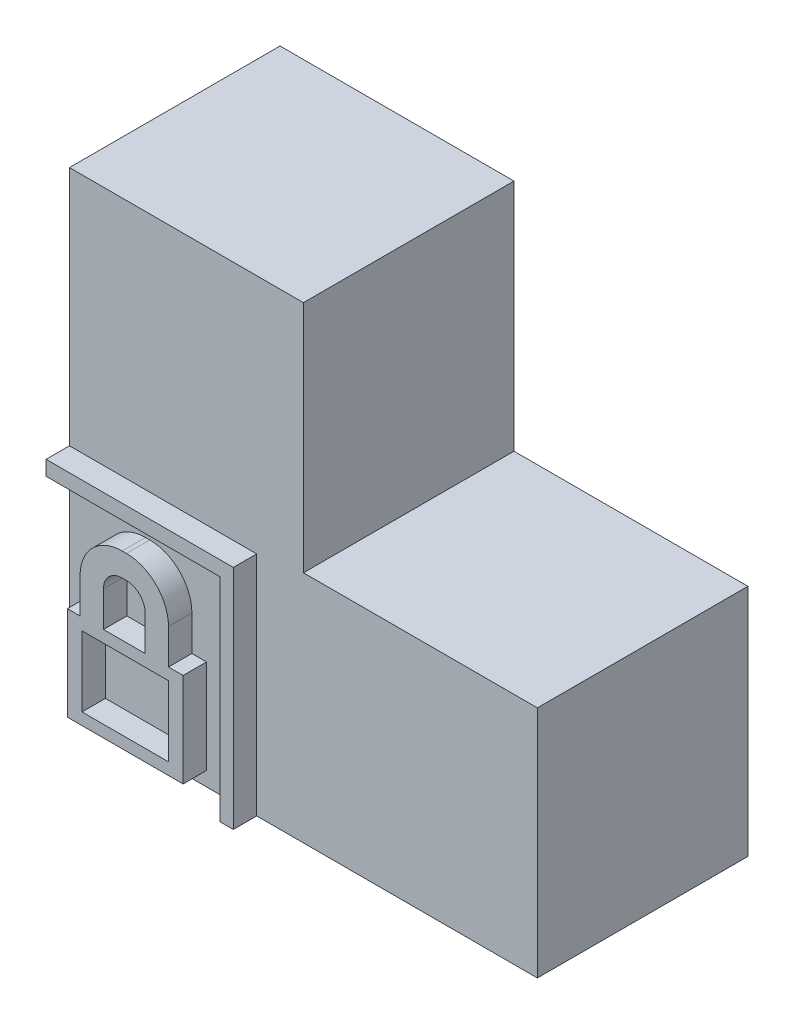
ISO-10303-21;
HEADER;
FILE_DESCRIPTION(('STEP AP214'),'2;1');
FILE_NAME('part.step','',(''),(''),'','','');
FILE_SCHEMA(('AUTOMOTIVE_DESIGN { 1 0 10303 214 1 1 1 1 }'));
ENDSEC;
DATA;
#1=APPLICATION_CONTEXT('core data for automotive mechanical design processes');
#2=APPLICATION_PROTOCOL_DEFINITION('international standard','automotive_design',2000,#1);
#3=PRODUCT_CONTEXT('',#1,'mechanical');
#4=PRODUCT('Part','Part','',(#3));
#5=PRODUCT_RELATED_PRODUCT_CATEGORY('part','',(#4));
#6=PRODUCT_DEFINITION_FORMATION('','',#4);
#7=PRODUCT_DEFINITION_CONTEXT('part definition',#1,'design');
#8=PRODUCT_DEFINITION('design','',#6,#7);
#9=PRODUCT_DEFINITION_SHAPE('','',#8);
#10=(LENGTH_UNIT() NAMED_UNIT(*) SI_UNIT(.MILLI.,.METRE.));
#11=(NAMED_UNIT(*) PLANE_ANGLE_UNIT() SI_UNIT($,.RADIAN.));
#12=(NAMED_UNIT(*) SI_UNIT($,.STERADIAN.) SOLID_ANGLE_UNIT());
#13=UNCERTAINTY_MEASURE_WITH_UNIT(LENGTH_MEASURE(1.E-05),#10,'distance_accuracy_value','');
#14=(GEOMETRIC_REPRESENTATION_CONTEXT(3) GLOBAL_UNCERTAINTY_ASSIGNED_CONTEXT((#13)) GLOBAL_UNIT_ASSIGNED_CONTEXT((#10,
#11,#12)) REPRESENTATION_CONTEXT('',''));
#15=CARTESIAN_POINT('',(0.,0.,0.));
#16=DIRECTION('',(0.,0.,1.));
#17=DIRECTION('',(1.,0.,0.));
#18=AXIS2_PLACEMENT_3D('',#15,#16,#17);
#19=CARTESIAN_POINT('',(0.,0.,-0.300000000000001));
#20=DIRECTION('',(0.,0.,1.));
#21=DIRECTION('',(1.,0.,0.));
#22=AXIS2_PLACEMENT_3D('',#19,#20,#21);
#23=PLANE('',#22);
#24=DIRECTION('',(-1.,0.,0.));
#25=VECTOR('',#24,1.);
#26=CARTESIAN_POINT('',(-0.998170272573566,20.3855136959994,-0.300000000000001));
#27=LINE('',#26,#25);
#28=CARTESIAN_POINT('',(-0.998170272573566,20.3855136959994,-0.300000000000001));
#29=VERTEX_POINT('',#28);
#30=CARTESIAN_POINT('',(-5.,20.3855136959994,-0.300000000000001));
#31=VERTEX_POINT('',#30);
#32=EDGE_CURVE('E47',#29,#31,#27,.T.);
#33=ORIENTED_EDGE('',*,*,#32,.F.);
#34=DIRECTION('',(0.,1.,0.));
#35=VECTOR('',#34,1.);
#36=CARTESIAN_POINT('',(-0.998170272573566,15.5354081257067,-0.300000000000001));
#37=LINE('',#36,#35);
#38=CARTESIAN_POINT('',(-0.998170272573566,15.5354081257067,-0.300000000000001));
#39=VERTEX_POINT('',#38);
#40=EDGE_CURVE('E479',#39,#29,#37,.T.);
#41=ORIENTED_EDGE('',*,*,#40,.F.);
#42=DIRECTION('',(1.,0.,0.));
#43=VECTOR('',#42,1.);
#44=CARTESIAN_POINT('',(-5.,15.5354081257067,-0.300000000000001));
#45=LINE('',#44,#43);
#46=CARTESIAN_POINT('',(5.,15.5354081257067,-0.300000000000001));
#47=VERTEX_POINT('',#46);
#48=EDGE_CURVE('E264',#39,#47,#45,.T.);
#49=ORIENTED_EDGE('',*,*,#48,.T.);
#50=DIRECTION('',(0.,1.,0.));
#51=VECTOR('',#50,1.);
#52=CARTESIAN_POINT('',(5.,20.5354081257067,-0.300000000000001));
#53=LINE('',#52,#51);
#54=CARTESIAN_POINT('',(5.,20.5354081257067,-0.300000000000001));
#55=VERTEX_POINT('',#54);
#56=EDGE_CURVE('E414',#47,#55,#53,.T.);
#57=ORIENTED_EDGE('',*,*,#56,.T.);
#58=DIRECTION('',(-1.,0.,0.));
#59=VECTOR('',#58,1.);
#60=CARTESIAN_POINT('',(0.,20.5354081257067,-0.300000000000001));
#61=LINE('',#60,#59);
#62=CARTESIAN_POINT('',(0.,20.5354081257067,-0.300000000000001));
#63=VERTEX_POINT('',#62);
#64=EDGE_CURVE('E417',#55,#63,#61,.T.);
#65=ORIENTED_EDGE('',*,*,#64,.T.);
#66=DIRECTION('',(0.,1.,0.));
#67=VECTOR('',#66,1.);
#68=CARTESIAN_POINT('',(0.,25.5354081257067,-0.300000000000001));
#69=LINE('',#68,#67);
#70=CARTESIAN_POINT('',(0.,25.5354081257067,-0.300000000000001));
#71=VERTEX_POINT('',#70);
#72=EDGE_CURVE('E420',#63,#71,#69,.T.);
#73=ORIENTED_EDGE('',*,*,#72,.T.);
#74=DIRECTION('',(-1.,0.,0.));
#75=VECTOR('',#74,1.);
#76=CARTESIAN_POINT('',(-5.,25.5354081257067,-0.300000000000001));
#77=LINE('',#76,#75);
#78=CARTESIAN_POINT('',(-5.,25.5354081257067,-0.300000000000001));
#79=VERTEX_POINT('',#78);
#80=EDGE_CURVE('E422',#71,#79,#77,.T.);
#81=ORIENTED_EDGE('',*,*,#80,.T.);
#82=DIRECTION('',(0.,-1.,0.));
#83=VECTOR('',#82,1.);
#84=CARTESIAN_POINT('',(-5.,25.5354081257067,-0.300000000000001));
#85=LINE('',#84,#83);
#86=EDGE_CURVE('E425',#79,#31,#85,.T.);
#87=ORIENTED_EDGE('',*,*,#86,.T.);
#88=EDGE_LOOP('',(#33,#41,#49,#57,#65,#73,#81,#87));
#89=FACE_BOUND('',#88,.T.);
#90=ADVANCED_FACE('F32',(#89),#23,.T.);
#91=DIRECTION('',(-1.,0.,0.));
#92=VECTOR('',#91,1.);
#93=CARTESIAN_POINT('',(-2.38364349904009,17.8496393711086,-0.300000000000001));
#94=LINE('',#93,#92);
#95=CARTESIAN_POINT('',(-2.07135715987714,17.8496393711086,-0.300000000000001));
#96=VERTEX_POINT('',#95);
#97=CARTESIAN_POINT('',(-2.38364349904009,17.8496393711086,-0.300000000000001));
#98=VERTEX_POINT('',#97);
#99=EDGE_CURVE('E368',#96,#98,#94,.T.);
#100=ORIENTED_EDGE('',*,*,#99,.F.);
#101=DIRECTION('',(0.,1.,0.));
#102=VECTOR('',#101,1.);
#103=CARTESIAN_POINT('',(-2.07135715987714,17.8496393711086,-0.300000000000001));
#104=LINE('',#103,#102);
#105=CARTESIAN_POINT('',(-2.07135715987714,15.8405534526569,-0.300000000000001));
#106=VERTEX_POINT('',#105);
#107=EDGE_CURVE('E342',#106,#96,#104,.T.);
#108=ORIENTED_EDGE('',*,*,#107,.F.);
#109=DIRECTION('',(1.,0.,0.));
#110=VECTOR('',#109,1.);
#111=CARTESIAN_POINT('',(-4.54407030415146,15.8405534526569,-0.300000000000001));
#112=LINE('',#111,#110);
#113=CARTESIAN_POINT('',(-4.54407030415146,15.8405534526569,-0.300000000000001));
#114=VERTEX_POINT('',#113);
#115=EDGE_CURVE('E347',#114,#106,#112,.T.);
#116=ORIENTED_EDGE('',*,*,#115,.F.);
#117=DIRECTION('',(0.,-1.,0.));
#118=VECTOR('',#117,1.);
#119=CARTESIAN_POINT('',(-4.54407030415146,17.8496393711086,-0.300000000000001));
#120=LINE('',#119,#118);
#121=CARTESIAN_POINT('',(-4.54407030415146,17.8496393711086,-0.300000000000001));
#122=VERTEX_POINT('',#121);
#123=EDGE_CURVE('E382',#122,#114,#120,.T.);
#124=ORIENTED_EDGE('',*,*,#123,.F.);
#125=DIRECTION('',(-1.,0.,0.));
#126=VECTOR('',#125,1.);
#127=CARTESIAN_POINT('',(-4.54407030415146,17.8496393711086,-0.300000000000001));
#128=LINE('',#127,#126);
#129=CARTESIAN_POINT('',(-4.27338849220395,17.8496393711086,-0.300000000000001));
#130=VERTEX_POINT('',#129);
#131=EDGE_CURVE('E380',#130,#122,#128,.T.);
#132=ORIENTED_EDGE('',*,*,#131,.F.);
#133=DIRECTION('',(0.,-1.,0.));
#134=VECTOR('',#133,1.);
#135=CARTESIAN_POINT('',(-4.27338849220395,17.8496393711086,-0.300000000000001));
#136=LINE('',#135,#134);
#137=CARTESIAN_POINT('',(-4.27338849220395,18.60203802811,-0.300000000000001));
#138=VERTEX_POINT('',#137);
#139=EDGE_CURVE('E378',#138,#130,#136,.T.);
#140=ORIENTED_EDGE('',*,*,#139,.F.);
#141=CARTESIAN_POINT('',(-3.37338849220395,18.60203802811,-0.300000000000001));
#142=DIRECTION('',(0.,0.,1.));
#143=DIRECTION('',(-1.,0.,0.));
#144=AXIS2_PLACEMENT_3D('',#141,#142,#143);
#145=CIRCLE('',#144,0.899999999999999);
#146=CARTESIAN_POINT('',(-3.37338849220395,19.50203802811,-0.300000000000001));
#147=VERTEX_POINT('',#146);
#148=EDGE_CURVE('E376',#147,#138,#145,.T.);
#149=ORIENTED_EDGE('',*,*,#148,.F.);
#150=DIRECTION('',(-1.,0.,0.));
#151=VECTOR('',#150,1.);
#152=CARTESIAN_POINT('',(-3.37338849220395,19.50203802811,-0.300000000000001));
#153=LINE('',#152,#151);
#154=CARTESIAN_POINT('',(-3.28364349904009,19.50203802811,-0.300000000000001));
#155=VERTEX_POINT('',#154);
#156=EDGE_CURVE('E374',#155,#147,#153,.T.);
#157=ORIENTED_EDGE('',*,*,#156,.F.);
#158=CARTESIAN_POINT('',(-3.28364349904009,18.60203802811,-0.300000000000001));
#159=DIRECTION('',(0.,0.,1.));
#160=DIRECTION('',(-1.,0.,0.));
#161=AXIS2_PLACEMENT_3D('',#158,#159,#160);
#162=CIRCLE('',#161,0.900000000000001);
#163=CARTESIAN_POINT('',(-2.38364349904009,18.60203802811,-0.300000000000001));
#164=VERTEX_POINT('',#163);
#165=EDGE_CURVE('E372',#164,#155,#162,.T.);
#166=ORIENTED_EDGE('',*,*,#165,.F.);
#167=DIRECTION('',(0.,1.,0.));
#168=VECTOR('',#167,1.);
#169=CARTESIAN_POINT('',(-2.38364349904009,17.8496393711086,-0.300000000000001));
#170=LINE('',#169,#168);
#171=EDGE_CURVE('E370',#98,#164,#170,.T.);
#172=ORIENTED_EDGE('',*,*,#171,.F.);
#173=EDGE_LOOP('',(#100,#108,#116,#124,#132,#140,#149,#157,#166,#172));
#174=FACE_BOUND('',#173,.T.);
#175=DIRECTION('',(0.,-1.,0.));
#176=VECTOR('',#175,1.);
#177=CARTESIAN_POINT('',(-1.28634752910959,20.071138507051,-0.300000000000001));
#178=LINE('',#177,#176);
#179=CARTESIAN_POINT('',(-1.28634752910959,20.071138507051,-0.300000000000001));
#180=VERTEX_POINT('',#179);
#181=CARTESIAN_POINT('',(-1.28634752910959,15.5354081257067,-0.300000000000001));
#182=VERTEX_POINT('',#181);
#183=EDGE_CURVE('E55',#180,#182,#178,.T.);
#184=ORIENTED_EDGE('',*,*,#183,.F.);
#185=DIRECTION('',(1.,0.,0.));
#186=VECTOR('',#185,1.);
#187=CARTESIAN_POINT('',(-5.,20.071138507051,-0.300000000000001));
#188=LINE('',#187,#186);
#189=CARTESIAN_POINT('',(-5.,20.071138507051,-0.300000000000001));
#190=VERTEX_POINT('',#189);
#191=EDGE_CURVE('E478',#190,#180,#188,.T.);
#192=ORIENTED_EDGE('',*,*,#191,.F.);
#193=CARTESIAN_POINT('',(-5.,15.5354081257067,-0.300000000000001));
#194=VERTEX_POINT('',#193);
#195=EDGE_CURVE('E424',#190,#194,#85,.T.);
#196=ORIENTED_EDGE('',*,*,#195,.T.);
#197=EDGE_CURVE('E427',#194,#182,#45,.T.);
#198=ORIENTED_EDGE('',*,*,#197,.T.);
#199=EDGE_LOOP('',(#184,#192,#196,#198));
#200=FACE_BOUND('',#199,.T.);
#201=ADVANCED_FACE('F502',(#174,#200),#23,.T.);
#202=CARTESIAN_POINT('',(5.,20.5354081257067,-0.300000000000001));
#203=DIRECTION('',(-1.,0.,0.));
#204=DIRECTION('',(0.,-1.,0.));
#205=AXIS2_PLACEMENT_3D('',#202,#203,#204);
#206=PLANE('',#205);
#207=DIRECTION('',(0.,1.,0.));
#208=VECTOR('',#207,1.);
#209=CARTESIAN_POINT('',(5.,20.5354081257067,-4.8));
#210=LINE('',#209,#208);
#211=CARTESIAN_POINT('',(5.,15.5354081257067,-4.8));
#212=VERTEX_POINT('',#211);
#213=CARTESIAN_POINT('',(5.,20.5354081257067,-4.8));
#214=VERTEX_POINT('',#213);
#215=EDGE_CURVE('E413',#212,#214,#210,.T.);
#216=ORIENTED_EDGE('',*,*,#215,.T.);
#217=DIRECTION('',(0.,0.,-1.));
#218=VECTOR('',#217,1.);
#219=CARTESIAN_POINT('',(5.,20.5354081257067,-0.300000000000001));
#220=LINE('',#219,#218);
#221=EDGE_CURVE('E11',#55,#214,#220,.T.);
#222=ORIENTED_EDGE('',*,*,#221,.F.);
#223=ORIENTED_EDGE('',*,*,#56,.F.);
#224=DIRECTION('',(0.,0.,-1.));
#225=VECTOR('',#224,1.);
#226=CARTESIAN_POINT('',(5.,15.5354081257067,-0.300000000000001));
#227=LINE('',#226,#225);
#228=EDGE_CURVE('E429',#47,#212,#227,.T.);
#229=ORIENTED_EDGE('',*,*,#228,.T.);
#230=EDGE_LOOP('',(#216,#222,#223,#229));
#231=FACE_BOUND('',#230,.T.);
#232=ADVANCED_FACE('F34',(#231),#206,.F.);
#233=CARTESIAN_POINT('',(0.,20.5354081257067,-0.300000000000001));
#234=DIRECTION('',(0.,-1.,0.));
#235=DIRECTION('',(1.,0.,0.));
#236=AXIS2_PLACEMENT_3D('',#233,#234,#235);
#237=PLANE('',#236);
#238=DIRECTION('',(-1.,0.,0.));
#239=VECTOR('',#238,1.);
#240=CARTESIAN_POINT('',(0.,20.5354081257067,-4.8));
#241=LINE('',#240,#239);
#242=CARTESIAN_POINT('',(0.,20.5354081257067,-4.8));
#243=VERTEX_POINT('',#242);
#244=EDGE_CURVE('E432',#214,#243,#241,.T.);
#245=ORIENTED_EDGE('',*,*,#244,.T.);
#246=DIRECTION('',(0.,0.,-1.));
#247=VECTOR('',#246,1.);
#248=CARTESIAN_POINT('',(0.,20.5354081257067,-0.300000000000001));
#249=LINE('',#248,#247);
#250=EDGE_CURVE('E40',#63,#243,#249,.T.);
#251=ORIENTED_EDGE('',*,*,#250,.F.);
#252=ORIENTED_EDGE('',*,*,#64,.F.);
#253=ORIENTED_EDGE('',*,*,#221,.T.);
#254=EDGE_LOOP('',(#245,#251,#252,#253));
#255=FACE_BOUND('',#254,.T.);
#256=ADVANCED_FACE('F828',(#255),#237,.F.);
#257=CARTESIAN_POINT('',(0.,25.5354081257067,-0.300000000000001));
#258=DIRECTION('',(-1.,0.,0.));
#259=DIRECTION('',(0.,-1.,0.));
#260=AXIS2_PLACEMENT_3D('',#257,#258,#259);
#261=PLANE('',#260);
#262=DIRECTION('',(0.,1.,0.));
#263=VECTOR('',#262,1.);
#264=CARTESIAN_POINT('',(0.,25.5354081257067,-4.8));
#265=LINE('',#264,#263);
#266=CARTESIAN_POINT('',(0.,25.5354081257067,-4.8));
#267=VERTEX_POINT('',#266);
#268=EDGE_CURVE('E434',#243,#267,#265,.T.);
#269=ORIENTED_EDGE('',*,*,#268,.T.);
#270=DIRECTION('',(0.,0.,-1.));
#271=VECTOR('',#270,1.);
#272=CARTESIAN_POINT('',(0.,25.5354081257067,-0.300000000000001));
#273=LINE('',#272,#271);
#274=EDGE_CURVE('E449',#71,#267,#273,.T.);
#275=ORIENTED_EDGE('',*,*,#274,.F.);
#276=ORIENTED_EDGE('',*,*,#72,.F.);
#277=ORIENTED_EDGE('',*,*,#250,.T.);
#278=EDGE_LOOP('',(#269,#275,#276,#277));
#279=FACE_BOUND('',#278,.T.);
#280=ADVANCED_FACE('F456',(#279),#261,.F.);
#281=CARTESIAN_POINT('',(-5.,25.5354081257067,-0.300000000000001));
#282=DIRECTION('',(0.,-1.,0.));
#283=DIRECTION('',(0.,0.,-1.));
#284=AXIS2_PLACEMENT_3D('',#281,#282,#283);
#285=PLANE('',#284);
#286=DIRECTION('',(-1.,0.,0.));
#287=VECTOR('',#286,1.);
#288=CARTESIAN_POINT('',(-5.,25.5354081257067,-4.8));
#289=LINE('',#288,#287);
#290=CARTESIAN_POINT('',(-5.,25.5354081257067,-4.8));
#291=VERTEX_POINT('',#290);
#292=EDGE_CURVE('E436',#267,#291,#289,.T.);
#293=ORIENTED_EDGE('',*,*,#292,.T.);
#294=DIRECTION('',(0.,0.,-1.));
#295=VECTOR('',#294,1.);
#296=CARTESIAN_POINT('',(-5.,25.5354081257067,-0.300000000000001));
#297=LINE('',#296,#295);
#298=EDGE_CURVE('E446',#79,#291,#297,.T.);
#299=ORIENTED_EDGE('',*,*,#298,.F.);
#300=ORIENTED_EDGE('',*,*,#80,.F.);
#301=ORIENTED_EDGE('',*,*,#274,.T.);
#302=EDGE_LOOP('',(#293,#299,#300,#301));
#303=FACE_BOUND('',#302,.T.);
#304=ADVANCED_FACE('F467',(#303),#285,.F.);
#305=CARTESIAN_POINT('',(-5.,25.5354081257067,-0.300000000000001));
#306=DIRECTION('',(1.,0.,0.));
#307=DIRECTION('',(0.,0.,-1.));
#308=AXIS2_PLACEMENT_3D('',#305,#306,#307);
#309=PLANE('',#308);
#310=DIRECTION('',(0.,-1.,0.));
#311=VECTOR('',#310,1.);
#312=CARTESIAN_POINT('',(-5.,25.5354081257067,-4.8));
#313=LINE('',#312,#311);
#314=CARTESIAN_POINT('',(-5.,15.5354081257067,-4.8));
#315=VERTEX_POINT('',#314);
#316=EDGE_CURVE('E438',#291,#315,#313,.T.);
#317=ORIENTED_EDGE('',*,*,#316,.T.);
#318=DIRECTION('',(0.,0.,-1.));
#319=VECTOR('',#318,1.);
#320=CARTESIAN_POINT('',(-5.,15.5354081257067,-0.300000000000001));
#321=LINE('',#320,#319);
#322=EDGE_CURVE('E443',#194,#315,#321,.T.);
#323=ORIENTED_EDGE('',*,*,#322,.F.);
#324=ORIENTED_EDGE('',*,*,#195,.F.);
#325=DIRECTION('',(0.,0.,-1.));
#326=VECTOR('',#325,1.);
#327=CARTESIAN_POINT('',(-5.,20.071138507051,0.199999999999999));
#328=LINE('',#327,#326);
#329=CARTESIAN_POINT('',(-5.,20.071138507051,0.199999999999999));
#330=VERTEX_POINT('',#329);
#331=EDGE_CURVE('E491',#330,#190,#328,.T.);
#332=ORIENTED_EDGE('',*,*,#331,.F.);
#333=DIRECTION('',(0.,-1.,0.));
#334=VECTOR('',#333,1.);
#335=CARTESIAN_POINT('',(-5.,20.3855136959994,0.199999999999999));
#336=LINE('',#335,#334);
#337=CARTESIAN_POINT('',(-5.,20.3855136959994,0.199999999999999));
#338=VERTEX_POINT('',#337);
#339=EDGE_CURVE('E500',#338,#330,#336,.T.);
#340=ORIENTED_EDGE('',*,*,#339,.F.);
#341=DIRECTION('',(0.,0.,-1.));
#342=VECTOR('',#341,1.);
#343=CARTESIAN_POINT('',(-5.,20.3855136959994,0.199999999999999));
#344=LINE('',#343,#342);
#345=EDGE_CURVE('E269',#338,#31,#344,.T.);
#346=ORIENTED_EDGE('',*,*,#345,.T.);
#347=ORIENTED_EDGE('',*,*,#86,.F.);
#348=ORIENTED_EDGE('',*,*,#298,.T.);
#349=EDGE_LOOP('',(#317,#323,#324,#332,#340,#346,#347,#348));
#350=FACE_BOUND('',#349,.T.);
#351=ADVANCED_FACE('F471',(#350),#309,.F.);
#352=CARTESIAN_POINT('',(-5.,15.5354081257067,-0.300000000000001));
#353=DIRECTION('',(0.,1.,0.));
#354=DIRECTION('',(0.,0.,1.));
#355=AXIS2_PLACEMENT_3D('',#352,#353,#354);
#356=PLANE('',#355);
#357=DIRECTION('',(1.,0.,0.));
#358=VECTOR('',#357,1.);
#359=CARTESIAN_POINT('',(-5.,15.5354081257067,-4.8));
#360=LINE('',#359,#358);
#361=EDGE_CURVE('E418',#315,#212,#360,.T.);
#362=ORIENTED_EDGE('',*,*,#361,.T.);
#363=ORIENTED_EDGE('',*,*,#228,.F.);
#364=ORIENTED_EDGE('',*,*,#48,.F.);
#365=DIRECTION('',(0.,0.,-1.));
#366=VECTOR('',#365,1.);
#367=CARTESIAN_POINT('',(-0.998170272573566,15.5354081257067,0.199999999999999));
#368=LINE('',#367,#366);
#369=CARTESIAN_POINT('',(-0.998170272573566,15.5354081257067,0.199999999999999));
#370=VERTEX_POINT('',#369);
#371=EDGE_CURVE('E246',#370,#39,#368,.T.);
#372=ORIENTED_EDGE('',*,*,#371,.F.);
#373=DIRECTION('',(1.,0.,0.));
#374=VECTOR('',#373,1.);
#375=CARTESIAN_POINT('',(-1.28634752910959,15.5354081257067,0.199999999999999));
#376=LINE('',#375,#374);
#377=CARTESIAN_POINT('',(-1.28634752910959,15.5354081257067,0.199999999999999));
#378=VERTEX_POINT('',#377);
#379=EDGE_CURVE('E252',#378,#370,#376,.T.);
#380=ORIENTED_EDGE('',*,*,#379,.F.);
#381=DIRECTION('',(0.,0.,-1.));
#382=VECTOR('',#381,1.);
#383=CARTESIAN_POINT('',(-1.28634752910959,15.5354081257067,0.199999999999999));
#384=LINE('',#383,#382);
#385=EDGE_CURVE('E486',#378,#182,#384,.T.);
#386=ORIENTED_EDGE('',*,*,#385,.T.);
#387=ORIENTED_EDGE('',*,*,#197,.F.);
#388=ORIENTED_EDGE('',*,*,#322,.T.);
#389=EDGE_LOOP('',(#362,#363,#364,#372,#380,#386,#387,#388));
#390=FACE_BOUND('',#389,.T.);
#391=ADVANCED_FACE('F262',(#390),#356,.F.);
#392=CARTESIAN_POINT('',(0.,0.,-4.8));
#393=DIRECTION('',(0.,0.,1.));
#394=DIRECTION('',(1.,0.,0.));
#395=AXIS2_PLACEMENT_3D('',#392,#393,#394);
#396=PLANE('',#395);
#397=ORIENTED_EDGE('',*,*,#215,.F.);
#398=ORIENTED_EDGE('',*,*,#361,.F.);
#399=ORIENTED_EDGE('',*,*,#316,.F.);
#400=ORIENTED_EDGE('',*,*,#292,.F.);
#401=ORIENTED_EDGE('',*,*,#268,.F.);
#402=ORIENTED_EDGE('',*,*,#244,.F.);
#403=EDGE_LOOP('',(#397,#398,#399,#400,#401,#402));
#404=FACE_BOUND('',#403,.T.);
#405=ADVANCED_FACE('F462',(#404),#396,.F.);
#406=CARTESIAN_POINT('',(-3.37338849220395,18.60203802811,0.199999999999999));
#407=DIRECTION('',(0.,0.,-1.));
#408=DIRECTION('',(-1.,0.,0.));
#409=AXIS2_PLACEMENT_3D('',#406,#407,#408);
#410=PLANE('',#409);
#411=DIRECTION('',(0.,1.,0.));
#412=VECTOR('',#411,1.);
#413=CARTESIAN_POINT('',(-2.38364349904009,17.5959059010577,0.199999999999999));
#414=LINE('',#413,#412);
#415=CARTESIAN_POINT('',(-2.38364349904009,16.0942869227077,0.199999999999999));
#416=VERTEX_POINT('',#415);
#417=CARTESIAN_POINT('',(-2.38364349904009,17.5959059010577,0.199999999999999));
#418=VERTEX_POINT('',#417);
#419=EDGE_CURVE('E314',#416,#418,#414,.T.);
#420=ORIENTED_EDGE('',*,*,#419,.F.);
#421=DIRECTION('',(1.,0.,0.));
#422=VECTOR('',#421,1.);
#423=CARTESIAN_POINT('',(-4.2317839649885,16.0942869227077,0.199999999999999));
#424=LINE('',#423,#422);
#425=CARTESIAN_POINT('',(-4.2317839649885,16.0942869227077,0.199999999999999));
#426=VERTEX_POINT('',#425);
#427=EDGE_CURVE('E322',#426,#416,#424,.T.);
#428=ORIENTED_EDGE('',*,*,#427,.F.);
#429=DIRECTION('',(0.,-1.,0.));
#430=VECTOR('',#429,1.);
#431=CARTESIAN_POINT('',(-4.2317839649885,17.5959059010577,0.199999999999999));
#432=LINE('',#431,#430);
#433=CARTESIAN_POINT('',(-4.2317839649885,17.5959059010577,0.199999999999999));
#434=VERTEX_POINT('',#433);
#435=EDGE_CURVE('E319',#434,#426,#432,.T.);
#436=ORIENTED_EDGE('',*,*,#435,.F.);
#437=DIRECTION('',(-1.,0.,0.));
#438=VECTOR('',#437,1.);
#439=CARTESIAN_POINT('',(-4.2317839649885,17.5959059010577,0.199999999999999));
#440=LINE('',#439,#438);
#441=EDGE_CURVE('E316',#418,#434,#440,.T.);
#442=ORIENTED_EDGE('',*,*,#441,.F.);
#443=EDGE_LOOP('',(#420,#428,#436,#442));
#444=FACE_BOUND('',#443,.T.);
#445=DIRECTION('',(0.,1.,0.));
#446=VECTOR('',#445,1.);
#447=CARTESIAN_POINT('',(-2.07135715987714,17.8496393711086,0.199999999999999));
#448=LINE('',#447,#446);
#449=CARTESIAN_POINT('',(-2.07135715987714,15.8405534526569,0.199999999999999));
#450=VERTEX_POINT('',#449);
#451=CARTESIAN_POINT('',(-2.07135715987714,17.8496393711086,0.199999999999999));
#452=VERTEX_POINT('',#451);
#453=EDGE_CURVE('E343',#450,#452,#448,.T.);
#454=ORIENTED_EDGE('',*,*,#453,.T.);
#455=DIRECTION('',(-1.,0.,0.));
#456=VECTOR('',#455,1.);
#457=CARTESIAN_POINT('',(-2.38364349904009,17.8496393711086,0.199999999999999));
#458=LINE('',#457,#456);
#459=CARTESIAN_POINT('',(-2.38364349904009,17.8496393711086,0.199999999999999));
#460=VERTEX_POINT('',#459);
#461=EDGE_CURVE('E346',#452,#460,#458,.T.);
#462=ORIENTED_EDGE('',*,*,#461,.T.);
#463=DIRECTION('',(0.,1.,0.));
#464=VECTOR('',#463,1.);
#465=CARTESIAN_POINT('',(-2.38364349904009,17.8496393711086,0.199999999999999));
#466=LINE('',#465,#464);
#467=CARTESIAN_POINT('',(-2.38364349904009,18.60203802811,0.199999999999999));
#468=VERTEX_POINT('',#467);
#469=EDGE_CURVE('E349',#460,#468,#466,.T.);
#470=ORIENTED_EDGE('',*,*,#469,.T.);
#471=CARTESIAN_POINT('',(-3.28364349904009,18.60203802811,0.199999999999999));
#472=DIRECTION('',(0.,0.,1.));
#473=DIRECTION('',(-1.,0.,0.));
#474=AXIS2_PLACEMENT_3D('',#471,#472,#473);
#475=CIRCLE('',#474,0.900000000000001);
#476=CARTESIAN_POINT('',(-3.28364349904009,19.50203802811,0.199999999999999));
#477=VERTEX_POINT('',#476);
#478=EDGE_CURVE('E351',#468,#477,#475,.T.);
#479=ORIENTED_EDGE('',*,*,#478,.T.);
#480=DIRECTION('',(-1.,0.,0.));
#481=VECTOR('',#480,1.);
#482=CARTESIAN_POINT('',(-3.37338849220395,19.50203802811,0.199999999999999));
#483=LINE('',#482,#481);
#484=CARTESIAN_POINT('',(-3.37338849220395,19.50203802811,0.199999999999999));
#485=VERTEX_POINT('',#484);
#486=EDGE_CURVE('E353',#477,#485,#483,.T.);
#487=ORIENTED_EDGE('',*,*,#486,.T.);
#488=CARTESIAN_POINT('',(-3.37338849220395,18.60203802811,0.199999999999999));
#489=DIRECTION('',(0.,0.,1.));
#490=DIRECTION('',(-1.,0.,0.));
#491=AXIS2_PLACEMENT_3D('',#488,#489,#490);
#492=CIRCLE('',#491,0.899999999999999);
#493=CARTESIAN_POINT('',(-4.27338849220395,18.60203802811,0.199999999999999));
#494=VERTEX_POINT('',#493);
#495=EDGE_CURVE('E355',#485,#494,#492,.T.);
#496=ORIENTED_EDGE('',*,*,#495,.T.);
#497=DIRECTION('',(0.,-1.,0.));
#498=VECTOR('',#497,1.);
#499=CARTESIAN_POINT('',(-4.27338849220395,17.8496393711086,0.199999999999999));
#500=LINE('',#499,#498);
#501=CARTESIAN_POINT('',(-4.27338849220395,17.8496393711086,0.199999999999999));
#502=VERTEX_POINT('',#501);
#503=EDGE_CURVE('E357',#494,#502,#500,.T.);
#504=ORIENTED_EDGE('',*,*,#503,.T.);
#505=DIRECTION('',(-1.,0.,0.));
#506=VECTOR('',#505,1.);
#507=CARTESIAN_POINT('',(-4.54407030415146,17.8496393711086,0.199999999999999));
#508=LINE('',#507,#506);
#509=CARTESIAN_POINT('',(-4.54407030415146,17.8496393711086,0.199999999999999));
#510=VERTEX_POINT('',#509);
#511=EDGE_CURVE('E359',#502,#510,#508,.T.);
#512=ORIENTED_EDGE('',*,*,#511,.T.);
#513=DIRECTION('',(0.,-1.,0.));
#514=VECTOR('',#513,1.);
#515=CARTESIAN_POINT('',(-4.54407030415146,17.8496393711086,0.199999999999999));
#516=LINE('',#515,#514);
#517=CARTESIAN_POINT('',(-4.54407030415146,15.8405534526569,0.199999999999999));
#518=VERTEX_POINT('',#517);
#519=EDGE_CURVE('E361',#510,#518,#516,.T.);
#520=ORIENTED_EDGE('',*,*,#519,.T.);
#521=DIRECTION('',(1.,0.,0.));
#522=VECTOR('',#521,1.);
#523=CARTESIAN_POINT('',(-4.54407030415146,15.8405534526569,0.199999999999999));
#524=LINE('',#523,#522);
#525=EDGE_CURVE('E363',#518,#450,#524,.T.);
#526=ORIENTED_EDGE('',*,*,#525,.T.);
#527=EDGE_LOOP('',(#454,#462,#470,#479,#487,#496,#504,#512,#520,#526));
#528=FACE_BOUND('',#527,.T.);
#529=DIRECTION('',(1.,0.,0.));
#530=VECTOR('',#529,1.);
#531=CARTESIAN_POINT('',(-3.77338849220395,17.8496393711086,0.199999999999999));
#532=LINE('',#531,#530);
#533=CARTESIAN_POINT('',(-3.77338849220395,17.8496393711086,0.199999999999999));
#534=VERTEX_POINT('',#533);
#535=CARTESIAN_POINT('',(-2.88364349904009,17.8496393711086,0.199999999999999));
#536=VERTEX_POINT('',#535);
#537=EDGE_CURVE('E273',#534,#536,#532,.T.);
#538=ORIENTED_EDGE('',*,*,#537,.F.);
#539=DIRECTION('',(0.,-1.,0.));
#540=VECTOR('',#539,1.);
#541=CARTESIAN_POINT('',(-3.77338849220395,17.8496393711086,0.199999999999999));
#542=LINE('',#541,#540);
#543=CARTESIAN_POINT('',(-3.77338849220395,18.60203802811,0.199999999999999));
#544=VERTEX_POINT('',#543);
#545=EDGE_CURVE('E285',#544,#534,#542,.T.);
#546=ORIENTED_EDGE('',*,*,#545,.F.);
#547=CARTESIAN_POINT('',(-3.37338849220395,18.60203802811,0.199999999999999));
#548=DIRECTION('',(0.,0.,1.));
#549=DIRECTION('',(-1.,0.,0.));
#550=AXIS2_PLACEMENT_3D('',#547,#548,#549);
#551=CIRCLE('',#550,0.399999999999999);
#552=CARTESIAN_POINT('',(-3.37338849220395,19.00203802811,0.199999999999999));
#553=VERTEX_POINT('',#552);
#554=EDGE_CURVE('E282',#553,#544,#551,.T.);
#555=ORIENTED_EDGE('',*,*,#554,.F.);
#556=DIRECTION('',(-1.,0.,0.));
#557=VECTOR('',#556,1.);
#558=CARTESIAN_POINT('',(-3.37338849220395,19.00203802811,0.199999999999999));
#559=LINE('',#558,#557);
#560=CARTESIAN_POINT('',(-3.28364349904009,19.00203802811,0.199999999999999));
#561=VERTEX_POINT('',#560);
#562=EDGE_CURVE('E280',#561,#553,#559,.T.);
#563=ORIENTED_EDGE('',*,*,#562,.F.);
#564=CARTESIAN_POINT('',(-3.28364349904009,18.60203802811,0.199999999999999));
#565=DIRECTION('',(0.,0.,1.));
#566=DIRECTION('',(-1.,0.,0.));
#567=AXIS2_PLACEMENT_3D('',#564,#565,#566);
#568=CIRCLE('',#567,0.4);
#569=CARTESIAN_POINT('',(-2.88364349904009,18.60203802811,0.199999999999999));
#570=VERTEX_POINT('',#569);
#571=EDGE_CURVE('E278',#570,#561,#568,.T.);
#572=ORIENTED_EDGE('',*,*,#571,.F.);
#573=DIRECTION('',(0.,1.,0.));
#574=VECTOR('',#573,1.);
#575=CARTESIAN_POINT('',(-2.88364349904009,17.8496393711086,0.199999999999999));
#576=LINE('',#575,#574);
#577=EDGE_CURVE('E275',#536,#570,#576,.T.);
#578=ORIENTED_EDGE('',*,*,#577,.F.);
#579=EDGE_LOOP('',(#538,#546,#555,#563,#572,#578));
#580=FACE_BOUND('',#579,.T.);
#581=ADVANCED_FACE('F552',(#444,#528,#580),#410,.F.);
#582=CARTESIAN_POINT('',(-2.07135715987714,17.8496393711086,0.199999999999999));
#583=DIRECTION('',(-1.,0.,0.));
#584=DIRECTION('',(0.,0.,1.));
#585=AXIS2_PLACEMENT_3D('',#582,#583,#584);
#586=PLANE('',#585);
#587=ORIENTED_EDGE('',*,*,#107,.T.);
#588=DIRECTION('',(0.,0.,-1.));
#589=VECTOR('',#588,1.);
#590=CARTESIAN_POINT('',(-2.07135715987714,17.8496393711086,0.199999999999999));
#591=LINE('',#590,#589);
#592=EDGE_CURVE('E411',#452,#96,#591,.T.);
#593=ORIENTED_EDGE('',*,*,#592,.F.);
#594=ORIENTED_EDGE('',*,*,#453,.F.);
#595=DIRECTION('',(0.,0.,-1.));
#596=VECTOR('',#595,1.);
#597=CARTESIAN_POINT('',(-2.07135715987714,15.8405534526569,0.199999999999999));
#598=LINE('',#597,#596);
#599=EDGE_CURVE('E365',#450,#106,#598,.T.);
#600=ORIENTED_EDGE('',*,*,#599,.T.);
#601=EDGE_LOOP('',(#587,#593,#594,#600));
#602=FACE_BOUND('',#601,.T.);
#603=ADVANCED_FACE('F598',(#602),#586,.F.);
#604=CARTESIAN_POINT('',(-2.38364349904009,17.8496393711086,0.199999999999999));
#605=DIRECTION('',(0.,-1.,0.));
#606=DIRECTION('',(0.,0.,-1.));
#607=AXIS2_PLACEMENT_3D('',#604,#605,#606);
#608=PLANE('',#607);
#609=ORIENTED_EDGE('',*,*,#99,.T.);
#610=DIRECTION('',(0.,0.,-1.));
#611=VECTOR('',#610,1.);
#612=CARTESIAN_POINT('',(-2.38364349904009,17.8496393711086,0.199999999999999));
#613=LINE('',#612,#611);
#614=EDGE_CURVE('E408',#460,#98,#613,.T.);
#615=ORIENTED_EDGE('',*,*,#614,.F.);
#616=ORIENTED_EDGE('',*,*,#461,.F.);
#617=ORIENTED_EDGE('',*,*,#592,.T.);
#618=EDGE_LOOP('',(#609,#615,#616,#617));
#619=FACE_BOUND('',#618,.T.);
#620=ADVANCED_FACE('F630',(#619),#608,.F.);
#621=CARTESIAN_POINT('',(-2.38364349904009,17.8496393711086,0.199999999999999));
#622=DIRECTION('',(-1.,0.,0.));
#623=DIRECTION('',(0.,0.,1.));
#624=AXIS2_PLACEMENT_3D('',#621,#622,#623);
#625=PLANE('',#624);
#626=ORIENTED_EDGE('',*,*,#171,.T.);
#627=DIRECTION('',(0.,0.,-1.));
#628=VECTOR('',#627,1.);
#629=CARTESIAN_POINT('',(-2.38364349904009,18.60203802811,0.199999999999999));
#630=LINE('',#629,#628);
#631=EDGE_CURVE('E405',#468,#164,#630,.T.);
#632=ORIENTED_EDGE('',*,*,#631,.F.);
#633=ORIENTED_EDGE('',*,*,#469,.F.);
#634=ORIENTED_EDGE('',*,*,#614,.T.);
#635=EDGE_LOOP('',(#626,#632,#633,#634));
#636=FACE_BOUND('',#635,.T.);
#637=ADVANCED_FACE('F626',(#636),#625,.F.);
#638=CARTESIAN_POINT('',(-3.28364349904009,18.60203802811,0.199999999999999));
#639=DIRECTION('',(0.,0.,-1.));
#640=DIRECTION('',(-1.,0.,0.));
#641=AXIS2_PLACEMENT_3D('',#638,#639,#640);
#642=CYLINDRICAL_SURFACE('',#641,0.900000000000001);
#643=ORIENTED_EDGE('',*,*,#165,.T.);
#644=DIRECTION('',(0.,0.,-1.));
#645=VECTOR('',#644,1.);
#646=CARTESIAN_POINT('',(-3.28364349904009,19.50203802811,0.199999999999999));
#647=LINE('',#646,#645);
#648=EDGE_CURVE('E402',#477,#155,#647,.T.);
#649=ORIENTED_EDGE('',*,*,#648,.F.);
#650=ORIENTED_EDGE('',*,*,#478,.F.);
#651=ORIENTED_EDGE('',*,*,#631,.T.);
#652=EDGE_LOOP('',(#643,#649,#650,#651));
#653=FACE_BOUND('',#652,.T.);
#654=ADVANCED_FACE('F622',(#653),#642,.T.);
#655=CARTESIAN_POINT('',(-3.37338849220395,19.50203802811,0.199999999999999));
#656=DIRECTION('',(0.,-1.,0.));
#657=DIRECTION('',(1.,0.,0.));
#658=AXIS2_PLACEMENT_3D('',#655,#656,#657);
#659=PLANE('',#658);
#660=ORIENTED_EDGE('',*,*,#156,.T.);
#661=DIRECTION('',(0.,0.,-1.));
#662=VECTOR('',#661,1.);
#663=CARTESIAN_POINT('',(-3.37338849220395,19.50203802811,0.199999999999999));
#664=LINE('',#663,#662);
#665=EDGE_CURVE('E399',#485,#147,#664,.T.);
#666=ORIENTED_EDGE('',*,*,#665,.F.);
#667=ORIENTED_EDGE('',*,*,#486,.F.);
#668=ORIENTED_EDGE('',*,*,#648,.T.);
#669=EDGE_LOOP('',(#660,#666,#667,#668));
#670=FACE_BOUND('',#669,.T.);
#671=ADVANCED_FACE('F618',(#670),#659,.F.);
#672=CARTESIAN_POINT('',(-3.37338849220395,18.60203802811,0.199999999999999));
#673=DIRECTION('',(0.,0.,-1.));
#674=DIRECTION('',(-1.,0.,0.));
#675=AXIS2_PLACEMENT_3D('',#672,#673,#674);
#676=CYLINDRICAL_SURFACE('',#675,0.899999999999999);
#677=ORIENTED_EDGE('',*,*,#148,.T.);
#678=DIRECTION('',(0.,0.,-1.));
#679=VECTOR('',#678,1.);
#680=CARTESIAN_POINT('',(-4.27338849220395,18.60203802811,0.199999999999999));
#681=LINE('',#680,#679);
#682=EDGE_CURVE('E396',#494,#138,#681,.T.);
#683=ORIENTED_EDGE('',*,*,#682,.F.);
#684=ORIENTED_EDGE('',*,*,#495,.F.);
#685=ORIENTED_EDGE('',*,*,#665,.T.);
#686=EDGE_LOOP('',(#677,#683,#684,#685));
#687=FACE_BOUND('',#686,.T.);
#688=ADVANCED_FACE('F614',(#687),#676,.T.);
#689=CARTESIAN_POINT('',(-4.27338849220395,17.8496393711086,0.199999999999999));
#690=DIRECTION('',(1.,0.,0.));
#691=DIRECTION('',(0.,0.,-1.));
#692=AXIS2_PLACEMENT_3D('',#689,#690,#691);
#693=PLANE('',#692);
#694=ORIENTED_EDGE('',*,*,#139,.T.);
#695=DIRECTION('',(0.,0.,-1.));
#696=VECTOR('',#695,1.);
#697=CARTESIAN_POINT('',(-4.27338849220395,17.8496393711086,0.199999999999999));
#698=LINE('',#697,#696);
#699=EDGE_CURVE('E393',#502,#130,#698,.T.);
#700=ORIENTED_EDGE('',*,*,#699,.F.);
#701=ORIENTED_EDGE('',*,*,#503,.F.);
#702=ORIENTED_EDGE('',*,*,#682,.T.);
#703=EDGE_LOOP('',(#694,#700,#701,#702));
#704=FACE_BOUND('',#703,.T.);
#705=ADVANCED_FACE('F610',(#704),#693,.F.);
#706=CARTESIAN_POINT('',(-4.54407030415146,17.8496393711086,0.199999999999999));
#707=DIRECTION('',(0.,-1.,0.));
#708=DIRECTION('',(0.,0.,-1.));
#709=AXIS2_PLACEMENT_3D('',#706,#707,#708);
#710=PLANE('',#709);
#711=ORIENTED_EDGE('',*,*,#131,.T.);
#712=DIRECTION('',(0.,0.,-1.));
#713=VECTOR('',#712,1.);
#714=CARTESIAN_POINT('',(-4.54407030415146,17.8496393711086,0.199999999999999));
#715=LINE('',#714,#713);
#716=EDGE_CURVE('E390',#510,#122,#715,.T.);
#717=ORIENTED_EDGE('',*,*,#716,.F.);
#718=ORIENTED_EDGE('',*,*,#511,.F.);
#719=ORIENTED_EDGE('',*,*,#699,.T.);
#720=EDGE_LOOP('',(#711,#717,#718,#719));
#721=FACE_BOUND('',#720,.T.);
#722=ADVANCED_FACE('F606',(#721),#710,.F.);
#723=CARTESIAN_POINT('',(-4.54407030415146,17.8496393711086,0.199999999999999));
#724=DIRECTION('',(1.,0.,0.));
#725=DIRECTION('',(0.,0.,-1.));
#726=AXIS2_PLACEMENT_3D('',#723,#724,#725);
#727=PLANE('',#726);
#728=ORIENTED_EDGE('',*,*,#123,.T.);
#729=DIRECTION('',(0.,0.,-1.));
#730=VECTOR('',#729,1.);
#731=CARTESIAN_POINT('',(-4.54407030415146,15.8405534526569,0.199999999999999));
#732=LINE('',#731,#730);
#733=EDGE_CURVE('E388',#518,#114,#732,.T.);
#734=ORIENTED_EDGE('',*,*,#733,.F.);
#735=ORIENTED_EDGE('',*,*,#519,.F.);
#736=ORIENTED_EDGE('',*,*,#716,.T.);
#737=EDGE_LOOP('',(#728,#734,#735,#736));
#738=FACE_BOUND('',#737,.T.);
#739=ADVANCED_FACE('F602',(#738),#727,.F.);
#740=CARTESIAN_POINT('',(-4.54407030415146,15.8405534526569,0.199999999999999));
#741=DIRECTION('',(0.,1.,0.));
#742=DIRECTION('',(0.,0.,1.));
#743=AXIS2_PLACEMENT_3D('',#740,#741,#742);
#744=PLANE('',#743);
#745=ORIENTED_EDGE('',*,*,#115,.T.);
#746=ORIENTED_EDGE('',*,*,#599,.F.);
#747=ORIENTED_EDGE('',*,*,#525,.F.);
#748=ORIENTED_EDGE('',*,*,#733,.T.);
#749=EDGE_LOOP('',(#745,#746,#747,#748));
#750=FACE_BOUND('',#749,.T.);
#751=ADVANCED_FACE('F594',(#750),#744,.F.);
#752=CARTESIAN_POINT('',(-2.38364349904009,17.5959059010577,0.199999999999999));
#753=DIRECTION('',(-1.,0.,0.));
#754=DIRECTION('',(0.,0.,1.));
#755=AXIS2_PLACEMENT_3D('',#752,#753,#754);
#756=PLANE('',#755);
#757=DIRECTION('',(0.,1.,0.));
#758=VECTOR('',#757,1.);
#759=CARTESIAN_POINT('',(-2.38364349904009,17.5959059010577,-0.300000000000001));
#760=LINE('',#759,#758);
#761=CARTESIAN_POINT('',(-2.38364349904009,16.0942869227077,-0.300000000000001));
#762=VERTEX_POINT('',#761);
#763=CARTESIAN_POINT('',(-2.38364349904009,17.5959059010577,-0.300000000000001));
#764=VERTEX_POINT('',#763);
#765=EDGE_CURVE('E313',#762,#764,#760,.T.);
#766=ORIENTED_EDGE('',*,*,#765,.F.);
#767=DIRECTION('',(0.,0.,-1.));
#768=VECTOR('',#767,1.);
#769=CARTESIAN_POINT('',(-2.38364349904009,16.0942869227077,0.199999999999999));
#770=LINE('',#769,#768);
#771=EDGE_CURVE('E324',#416,#762,#770,.T.);
#772=ORIENTED_EDGE('',*,*,#771,.F.);
#773=ORIENTED_EDGE('',*,*,#419,.T.);
#774=DIRECTION('',(0.,0.,-1.));
#775=VECTOR('',#774,1.);
#776=CARTESIAN_POINT('',(-2.38364349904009,17.5959059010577,0.199999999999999));
#777=LINE('',#776,#775);
#778=EDGE_CURVE('E339',#418,#764,#777,.T.);
#779=ORIENTED_EDGE('',*,*,#778,.T.);
#780=EDGE_LOOP('',(#766,#772,#773,#779));
#781=FACE_BOUND('',#780,.T.);
#782=ADVANCED_FACE('F590',(#781),#756,.T.);
#783=CARTESIAN_POINT('',(-4.2317839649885,17.5959059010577,0.199999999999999));
#784=DIRECTION('',(0.,-1.,0.));
#785=DIRECTION('',(0.,0.,-1.));
#786=AXIS2_PLACEMENT_3D('',#783,#784,#785);
#787=PLANE('',#786);
#788=DIRECTION('',(-1.,0.,0.));
#789=VECTOR('',#788,1.);
#790=CARTESIAN_POINT('',(-4.2317839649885,17.5959059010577,-0.300000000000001));
#791=LINE('',#790,#789);
#792=CARTESIAN_POINT('',(-4.2317839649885,17.5959059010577,-0.300000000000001));
#793=VERTEX_POINT('',#792);
#794=EDGE_CURVE('E326',#764,#793,#791,.T.);
#795=ORIENTED_EDGE('',*,*,#794,.F.);
#796=ORIENTED_EDGE('',*,*,#778,.F.);
#797=ORIENTED_EDGE('',*,*,#441,.T.);
#798=DIRECTION('',(0.,0.,-1.));
#799=VECTOR('',#798,1.);
#800=CARTESIAN_POINT('',(-4.2317839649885,17.5959059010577,0.199999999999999));
#801=LINE('',#800,#799);
#802=EDGE_CURVE('E336',#434,#793,#801,.T.);
#803=ORIENTED_EDGE('',*,*,#802,.T.);
#804=EDGE_LOOP('',(#795,#796,#797,#803));
#805=FACE_BOUND('',#804,.T.);
#806=ADVANCED_FACE('F586',(#805),#787,.T.);
#807=CARTESIAN_POINT('',(-4.2317839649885,17.5959059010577,0.199999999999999));
#808=DIRECTION('',(1.,0.,0.));
#809=DIRECTION('',(0.,0.,-1.));
#810=AXIS2_PLACEMENT_3D('',#807,#808,#809);
#811=PLANE('',#810);
#812=DIRECTION('',(0.,-1.,0.));
#813=VECTOR('',#812,1.);
#814=CARTESIAN_POINT('',(-4.2317839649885,17.5959059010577,-0.300000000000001));
#815=LINE('',#814,#813);
#816=CARTESIAN_POINT('',(-4.2317839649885,16.0942869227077,-0.300000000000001));
#817=VERTEX_POINT('',#816);
#818=EDGE_CURVE('E328',#793,#817,#815,.T.);
#819=ORIENTED_EDGE('',*,*,#818,.F.);
#820=ORIENTED_EDGE('',*,*,#802,.F.);
#821=ORIENTED_EDGE('',*,*,#435,.T.);
#822=DIRECTION('',(0.,0.,-1.));
#823=VECTOR('',#822,1.);
#824=CARTESIAN_POINT('',(-4.2317839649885,16.0942869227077,0.199999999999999));
#825=LINE('',#824,#823);
#826=EDGE_CURVE('E333',#426,#817,#825,.T.);
#827=ORIENTED_EDGE('',*,*,#826,.T.);
#828=EDGE_LOOP('',(#819,#820,#821,#827));
#829=FACE_BOUND('',#828,.T.);
#830=ADVANCED_FACE('F582',(#829),#811,.T.);
#831=CARTESIAN_POINT('',(-4.2317839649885,16.0942869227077,0.199999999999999));
#832=DIRECTION('',(0.,1.,0.));
#833=DIRECTION('',(0.,0.,1.));
#834=AXIS2_PLACEMENT_3D('',#831,#832,#833);
#835=PLANE('',#834);
#836=DIRECTION('',(1.,0.,0.));
#837=VECTOR('',#836,1.);
#838=CARTESIAN_POINT('',(-4.2317839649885,16.0942869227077,-0.300000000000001));
#839=LINE('',#838,#837);
#840=EDGE_CURVE('E317',#817,#762,#839,.T.);
#841=ORIENTED_EDGE('',*,*,#840,.F.);
#842=ORIENTED_EDGE('',*,*,#826,.F.);
#843=ORIENTED_EDGE('',*,*,#427,.T.);
#844=ORIENTED_EDGE('',*,*,#771,.T.);
#845=EDGE_LOOP('',(#841,#842,#843,#844));
#846=FACE_BOUND('',#845,.T.);
#847=ADVANCED_FACE('F579',(#846),#835,.T.);
#848=CARTESIAN_POINT('',(-3.77338849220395,17.8496393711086,0.199999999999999));
#849=DIRECTION('',(0.,1.,0.));
#850=DIRECTION('',(0.,0.,1.));
#851=AXIS2_PLACEMENT_3D('',#848,#849,#850);
#852=PLANE('',#851);
#853=DIRECTION('',(1.,0.,0.));
#854=VECTOR('',#853,1.);
#855=CARTESIAN_POINT('',(-3.77338849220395,17.8496393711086,-0.300000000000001));
#856=LINE('',#855,#854);
#857=CARTESIAN_POINT('',(-3.77338849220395,17.8496393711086,-0.300000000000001));
#858=VERTEX_POINT('',#857);
#859=CARTESIAN_POINT('',(-2.88364349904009,17.8496393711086,-0.300000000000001));
#860=VERTEX_POINT('',#859);
#861=EDGE_CURVE('E265',#858,#860,#856,.T.);
#862=ORIENTED_EDGE('',*,*,#861,.F.);
#863=DIRECTION('',(0.,0.,-1.));
#864=VECTOR('',#863,1.);
#865=CARTESIAN_POINT('',(-3.77338849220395,17.8496393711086,0.199999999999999));
#866=LINE('',#865,#864);
#867=EDGE_CURVE('E286',#534,#858,#866,.T.);
#868=ORIENTED_EDGE('',*,*,#867,.F.);
#869=ORIENTED_EDGE('',*,*,#537,.T.);
#870=DIRECTION('',(0.,0.,-1.));
#871=VECTOR('',#870,1.);
#872=CARTESIAN_POINT('',(-2.88364349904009,17.8496393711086,0.199999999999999));
#873=LINE('',#872,#871);
#874=EDGE_CURVE('E310',#536,#860,#873,.T.);
#875=ORIENTED_EDGE('',*,*,#874,.T.);
#876=EDGE_LOOP('',(#862,#868,#869,#875));
#877=FACE_BOUND('',#876,.T.);
#878=ADVANCED_FACE('F548',(#877),#852,.T.);
#879=CARTESIAN_POINT('',(-2.88364349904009,17.8496393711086,0.199999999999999));
#880=DIRECTION('',(-1.,0.,0.));
#881=DIRECTION('',(0.,0.,1.));
#882=AXIS2_PLACEMENT_3D('',#879,#880,#881);
#883=PLANE('',#882);
#884=DIRECTION('',(0.,1.,0.));
#885=VECTOR('',#884,1.);
#886=CARTESIAN_POINT('',(-2.88364349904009,17.8496393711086,-0.300000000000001));
#887=LINE('',#886,#885);
#888=CARTESIAN_POINT('',(-2.88364349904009,18.60203802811,-0.300000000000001));
#889=VERTEX_POINT('',#888);
#890=EDGE_CURVE('E267',#860,#889,#887,.T.);
#891=ORIENTED_EDGE('',*,*,#890,.F.);
#892=ORIENTED_EDGE('',*,*,#874,.F.);
#893=ORIENTED_EDGE('',*,*,#577,.T.);
#894=DIRECTION('',(0.,0.,-1.));
#895=VECTOR('',#894,1.);
#896=CARTESIAN_POINT('',(-2.88364349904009,18.60203802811,0.199999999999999));
#897=LINE('',#896,#895);
#898=EDGE_CURVE('E307',#570,#889,#897,.T.);
#899=ORIENTED_EDGE('',*,*,#898,.T.);
#900=EDGE_LOOP('',(#891,#892,#893,#899));
#901=FACE_BOUND('',#900,.T.);
#902=ADVANCED_FACE('F544',(#901),#883,.T.);
#903=CARTESIAN_POINT('',(-3.28364349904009,18.60203802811,0.199999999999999));
#904=DIRECTION('',(0.,0.,-1.));
#905=DIRECTION('',(-1.,0.,0.));
#906=AXIS2_PLACEMENT_3D('',#903,#904,#905);
#907=CYLINDRICAL_SURFACE('',#906,0.4);
#908=CARTESIAN_POINT('',(-3.28364349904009,18.60203802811,-0.300000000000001));
#909=DIRECTION('',(0.,0.,1.));
#910=DIRECTION('',(-1.,0.,0.));
#911=AXIS2_PLACEMENT_3D('',#908,#909,#910);
#912=CIRCLE('',#911,0.4);
#913=CARTESIAN_POINT('',(-3.28364349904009,19.00203802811,-0.300000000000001));
#914=VERTEX_POINT('',#913);
#915=EDGE_CURVE('E289',#889,#914,#912,.T.);
#916=ORIENTED_EDGE('',*,*,#915,.F.);
#917=ORIENTED_EDGE('',*,*,#898,.F.);
#918=ORIENTED_EDGE('',*,*,#571,.T.);
#919=DIRECTION('',(0.,0.,-1.));
#920=VECTOR('',#919,1.);
#921=CARTESIAN_POINT('',(-3.28364349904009,19.00203802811,0.199999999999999));
#922=LINE('',#921,#920);
#923=EDGE_CURVE('E304',#561,#914,#922,.T.);
#924=ORIENTED_EDGE('',*,*,#923,.T.);
#925=EDGE_LOOP('',(#916,#917,#918,#924));
#926=FACE_BOUND('',#925,.T.);
#927=ADVANCED_FACE('F557',(#926),#907,.F.);
#928=CARTESIAN_POINT('',(-3.37338849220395,19.00203802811,0.199999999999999));
#929=DIRECTION('',(0.,-1.,0.));
#930=DIRECTION('',(1.,0.,0.));
#931=AXIS2_PLACEMENT_3D('',#928,#929,#930);
#932=PLANE('',#931);
#933=DIRECTION('',(-1.,0.,0.));
#934=VECTOR('',#933,1.);
#935=CARTESIAN_POINT('',(-3.37338849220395,19.00203802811,-0.300000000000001));
#936=LINE('',#935,#934);
#937=CARTESIAN_POINT('',(-3.37338849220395,19.00203802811,-0.300000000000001));
#938=VERTEX_POINT('',#937);
#939=EDGE_CURVE('E291',#914,#938,#936,.T.);
#940=ORIENTED_EDGE('',*,*,#939,.F.);
#941=ORIENTED_EDGE('',*,*,#923,.F.);
#942=ORIENTED_EDGE('',*,*,#562,.T.);
#943=DIRECTION('',(0.,0.,-1.));
#944=VECTOR('',#943,1.);
#945=CARTESIAN_POINT('',(-3.37338849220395,19.00203802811,0.199999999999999));
#946=LINE('',#945,#944);
#947=EDGE_CURVE('E301',#553,#938,#946,.T.);
#948=ORIENTED_EDGE('',*,*,#947,.T.);
#949=EDGE_LOOP('',(#940,#941,#942,#948));
#950=FACE_BOUND('',#949,.T.);
#951=ADVANCED_FACE('F563',(#950),#932,.T.);
#952=CARTESIAN_POINT('',(-3.37338849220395,18.60203802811,0.199999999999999));
#953=DIRECTION('',(0.,0.,-1.));
#954=DIRECTION('',(-1.,0.,0.));
#955=AXIS2_PLACEMENT_3D('',#952,#953,#954);
#956=CYLINDRICAL_SURFACE('',#955,0.399999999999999);
#957=CARTESIAN_POINT('',(-3.37338849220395,18.60203802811,-0.300000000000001));
#958=DIRECTION('',(0.,0.,1.));
#959=DIRECTION('',(-1.,0.,0.));
#960=AXIS2_PLACEMENT_3D('',#957,#958,#959);
#961=CIRCLE('',#960,0.399999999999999);
#962=CARTESIAN_POINT('',(-3.77338849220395,18.60203802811,-0.300000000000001));
#963=VERTEX_POINT('',#962);
#964=EDGE_CURVE('E293',#938,#963,#961,.T.);
#965=ORIENTED_EDGE('',*,*,#964,.F.);
#966=ORIENTED_EDGE('',*,*,#947,.F.);
#967=ORIENTED_EDGE('',*,*,#554,.T.);
#968=DIRECTION('',(0.,0.,-1.));
#969=VECTOR('',#968,1.);
#970=CARTESIAN_POINT('',(-3.77338849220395,18.60203802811,0.199999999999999));
#971=LINE('',#970,#969);
#972=EDGE_CURVE('E298',#544,#963,#971,.T.);
#973=ORIENTED_EDGE('',*,*,#972,.T.);
#974=EDGE_LOOP('',(#965,#966,#967,#973));
#975=FACE_BOUND('',#974,.T.);
#976=ADVANCED_FACE('F534',(#975),#956,.F.);
#977=CARTESIAN_POINT('',(-3.77338849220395,17.8496393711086,0.199999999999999));
#978=DIRECTION('',(1.,0.,0.));
#979=DIRECTION('',(0.,0.,-1.));
#980=AXIS2_PLACEMENT_3D('',#977,#978,#979);
#981=PLANE('',#980);
#982=DIRECTION('',(0.,-1.,0.));
#983=VECTOR('',#982,1.);
#984=CARTESIAN_POINT('',(-3.77338849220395,17.8496393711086,-0.300000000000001));
#985=LINE('',#984,#983);
#986=EDGE_CURVE('E276',#963,#858,#985,.T.);
#987=ORIENTED_EDGE('',*,*,#986,.F.);
#988=ORIENTED_EDGE('',*,*,#972,.F.);
#989=ORIENTED_EDGE('',*,*,#545,.T.);
#990=ORIENTED_EDGE('',*,*,#867,.T.);
#991=EDGE_LOOP('',(#987,#988,#989,#990));
#992=FACE_BOUND('',#991,.T.);
#993=ADVANCED_FACE('F527',(#992),#981,.T.);
#994=ORIENTED_EDGE('',*,*,#861,.T.);
#995=ORIENTED_EDGE('',*,*,#890,.T.);
#996=ORIENTED_EDGE('',*,*,#915,.T.);
#997=ORIENTED_EDGE('',*,*,#939,.T.);
#998=ORIENTED_EDGE('',*,*,#964,.T.);
#999=ORIENTED_EDGE('',*,*,#986,.T.);
#1000=EDGE_LOOP('',(#994,#995,#996,#997,#998,#999));
#1001=FACE_BOUND('',#1000,.T.);
#1002=ADVANCED_FACE('F518',(#1001),#23,.T.);
#1003=ORIENTED_EDGE('',*,*,#765,.T.);
#1004=ORIENTED_EDGE('',*,*,#794,.T.);
#1005=ORIENTED_EDGE('',*,*,#818,.T.);
#1006=ORIENTED_EDGE('',*,*,#840,.T.);
#1007=EDGE_LOOP('',(#1003,#1004,#1005,#1006));
#1008=FACE_BOUND('',#1007,.T.);
#1009=ADVANCED_FACE('F523',(#1008),#23,.T.);
#1010=CARTESIAN_POINT('',(-0.998170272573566,15.5354081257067,0.199999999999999));
#1011=DIRECTION('',(-1.,0.,0.));
#1012=DIRECTION('',(0.,0.,1.));
#1013=AXIS2_PLACEMENT_3D('',#1010,#1011,#1012);
#1014=PLANE('',#1013);
#1015=ORIENTED_EDGE('',*,*,#40,.T.);
#1016=DIRECTION('',(0.,0.,-1.));
#1017=VECTOR('',#1016,1.);
#1018=CARTESIAN_POINT('',(-0.998170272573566,20.3855136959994,0.199999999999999));
#1019=LINE('',#1018,#1017);
#1020=CARTESIAN_POINT('',(-0.998170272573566,20.3855136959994,0.199999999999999));
#1021=VERTEX_POINT('',#1020);
#1022=EDGE_CURVE('E248',#1021,#29,#1019,.T.);
#1023=ORIENTED_EDGE('',*,*,#1022,.F.);
#1024=DIRECTION('',(0.,1.,0.));
#1025=VECTOR('',#1024,1.);
#1026=CARTESIAN_POINT('',(-0.998170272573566,15.5354081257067,0.199999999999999));
#1027=LINE('',#1026,#1025);
#1028=EDGE_CURVE('E242',#370,#1021,#1027,.T.);
#1029=ORIENTED_EDGE('',*,*,#1028,.F.);
#1030=ORIENTED_EDGE('',*,*,#371,.T.);
#1031=EDGE_LOOP('',(#1015,#1023,#1029,#1030));
#1032=FACE_BOUND('',#1031,.T.);
#1033=ADVANCED_FACE('F244',(#1032),#1014,.F.);
#1034=CARTESIAN_POINT('',(-0.998170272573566,20.3855136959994,0.199999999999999));
#1035=DIRECTION('',(0.,-1.,0.));
#1036=DIRECTION('',(0.,0.,-1.));
#1037=AXIS2_PLACEMENT_3D('',#1034,#1035,#1036);
#1038=PLANE('',#1037);
#1039=ORIENTED_EDGE('',*,*,#32,.T.);
#1040=ORIENTED_EDGE('',*,*,#345,.F.);
#1041=DIRECTION('',(-1.,0.,0.));
#1042=VECTOR('',#1041,1.);
#1043=CARTESIAN_POINT('',(-0.998170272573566,20.3855136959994,0.199999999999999));
#1044=LINE('',#1043,#1042);
#1045=EDGE_CURVE('E251',#1021,#338,#1044,.T.);
#1046=ORIENTED_EDGE('',*,*,#1045,.F.);
#1047=ORIENTED_EDGE('',*,*,#1022,.T.);
#1048=EDGE_LOOP('',(#1039,#1040,#1046,#1047));
#1049=FACE_BOUND('',#1048,.T.);
#1050=ADVANCED_FACE('F477',(#1049),#1038,.F.);
#1051=CARTESIAN_POINT('',(-5.,20.071138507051,0.199999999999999));
#1052=DIRECTION('',(0.,1.,0.));
#1053=DIRECTION('',(0.,0.,1.));
#1054=AXIS2_PLACEMENT_3D('',#1051,#1052,#1053);
#1055=PLANE('',#1054);
#1056=ORIENTED_EDGE('',*,*,#191,.T.);
#1057=DIRECTION('',(0.,0.,-1.));
#1058=VECTOR('',#1057,1.);
#1059=CARTESIAN_POINT('',(-1.28634752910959,20.071138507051,0.199999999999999));
#1060=LINE('',#1059,#1058);
#1061=CARTESIAN_POINT('',(-1.28634752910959,20.071138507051,0.199999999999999));
#1062=VERTEX_POINT('',#1061);
#1063=EDGE_CURVE('E488',#1062,#180,#1060,.T.);
#1064=ORIENTED_EDGE('',*,*,#1063,.F.);
#1065=DIRECTION('',(1.,0.,0.));
#1066=VECTOR('',#1065,1.);
#1067=CARTESIAN_POINT('',(-5.,20.071138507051,0.199999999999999));
#1068=LINE('',#1067,#1066);
#1069=EDGE_CURVE('E498',#330,#1062,#1068,.T.);
#1070=ORIENTED_EDGE('',*,*,#1069,.F.);
#1071=ORIENTED_EDGE('',*,*,#331,.T.);
#1072=EDGE_LOOP('',(#1056,#1064,#1070,#1071));
#1073=FACE_BOUND('',#1072,.T.);
#1074=ADVANCED_FACE('F496',(#1073),#1055,.F.);
#1075=CARTESIAN_POINT('',(-1.28634752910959,20.071138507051,0.199999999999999));
#1076=DIRECTION('',(1.,0.,0.));
#1077=DIRECTION('',(0.,0.,-1.));
#1078=AXIS2_PLACEMENT_3D('',#1075,#1076,#1077);
#1079=PLANE('',#1078);
#1080=ORIENTED_EDGE('',*,*,#183,.T.);
#1081=ORIENTED_EDGE('',*,*,#385,.F.);
#1082=DIRECTION('',(0.,-1.,0.));
#1083=VECTOR('',#1082,1.);
#1084=CARTESIAN_POINT('',(-1.28634752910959,20.071138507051,0.199999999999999));
#1085=LINE('',#1084,#1083);
#1086=EDGE_CURVE('E257',#1062,#378,#1085,.T.);
#1087=ORIENTED_EDGE('',*,*,#1086,.F.);
#1088=ORIENTED_EDGE('',*,*,#1063,.T.);
#1089=EDGE_LOOP('',(#1080,#1081,#1087,#1088));
#1090=FACE_BOUND('',#1089,.T.);
#1091=ADVANCED_FACE('F504',(#1090),#1079,.F.);
#1092=CARTESIAN_POINT('',(0.,0.,0.199999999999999));
#1093=DIRECTION('',(0.,0.,1.));
#1094=DIRECTION('',(1.,0.,0.));
#1095=AXIS2_PLACEMENT_3D('',#1092,#1093,#1094);
#1096=PLANE('',#1095);
#1097=ORIENTED_EDGE('',*,*,#379,.T.);
#1098=ORIENTED_EDGE('',*,*,#1028,.T.);
#1099=ORIENTED_EDGE('',*,*,#1045,.T.);
#1100=ORIENTED_EDGE('',*,*,#339,.T.);
#1101=ORIENTED_EDGE('',*,*,#1069,.T.);
#1102=ORIENTED_EDGE('',*,*,#1086,.T.);
#1103=EDGE_LOOP('',(#1097,#1098,#1099,#1100,#1101,#1102));
#1104=FACE_BOUND('',#1103,.T.);
#1105=ADVANCED_FACE('F255',(#1104),#1096,.T.);
#1106=CLOSED_SHELL('',(#90,#201,#232,#256,#280,#304,#351,#391,#405,#581,#603,#620,#637,#654,
#671,#688,#705,#722,#739,#751,#782,#806,#830,#847,#878,#902,#927,#951,#976,#993,#1002,#1009,
#1033,#1050,#1074,#1091,#1105));
#1107=MANIFOLD_SOLID_BREP('B2',#1106);
#1108=ADVANCED_BREP_SHAPE_REPRESENTATION('',(#18,#1107),#14);
#1109=SHAPE_DEFINITION_REPRESENTATION(#9,#1108);
ENDSEC;
END-ISO-10303-21;
